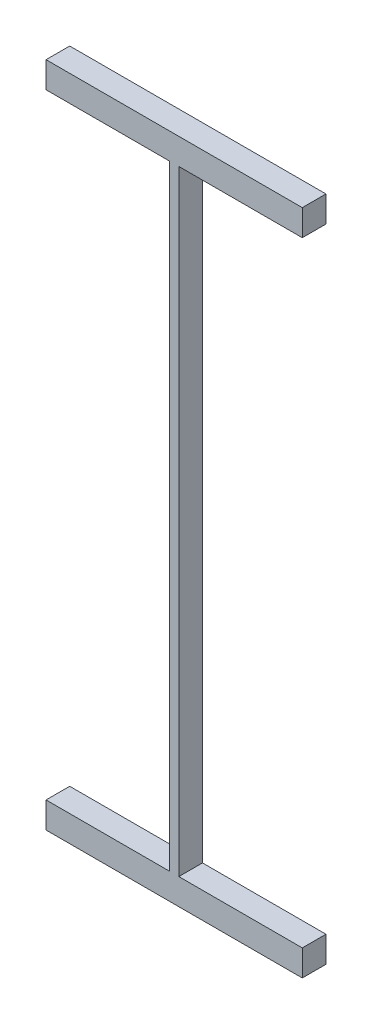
ISO-10303-21;
HEADER;
FILE_DESCRIPTION(('STEP AP214'),'2;1');
FILE_NAME('part.step','',(''),(''),'','','');
FILE_SCHEMA(('AUTOMOTIVE_DESIGN { 1 0 10303 214 1 1 1 1 }'));
ENDSEC;
DATA;
#1=APPLICATION_CONTEXT('core data for automotive mechanical design processes');
#2=APPLICATION_PROTOCOL_DEFINITION('international standard','automotive_design',2000,#1);
#3=PRODUCT_CONTEXT('',#1,'mechanical');
#4=PRODUCT('Part','Part','',(#3));
#5=PRODUCT_RELATED_PRODUCT_CATEGORY('part','',(#4));
#6=PRODUCT_DEFINITION_FORMATION('','',#4);
#7=PRODUCT_DEFINITION_CONTEXT('part definition',#1,'design');
#8=PRODUCT_DEFINITION('design','',#6,#7);
#9=PRODUCT_DEFINITION_SHAPE('','',#8);
#10=(LENGTH_UNIT() NAMED_UNIT(*) SI_UNIT(.MILLI.,.METRE.));
#11=(NAMED_UNIT(*) PLANE_ANGLE_UNIT() SI_UNIT($,.RADIAN.));
#12=(NAMED_UNIT(*) SI_UNIT($,.STERADIAN.) SOLID_ANGLE_UNIT());
#13=UNCERTAINTY_MEASURE_WITH_UNIT(LENGTH_MEASURE(1.E-05),#10,'distance_accuracy_value','');
#14=(GEOMETRIC_REPRESENTATION_CONTEXT(3) GLOBAL_UNCERTAINTY_ASSIGNED_CONTEXT((#13)) GLOBAL_UNIT_ASSIGNED_CONTEXT((#10,
#11,#12)) REPRESENTATION_CONTEXT('',''));
#15=CARTESIAN_POINT('',(0.,0.,0.));
#16=DIRECTION('',(0.,0.,1.));
#17=DIRECTION('',(1.,0.,0.));
#18=AXIS2_PLACEMENT_3D('',#15,#16,#17);
#19=CARTESIAN_POINT('',(-137.5,358.,12.7));
#20=DIRECTION('',(1.,0.,0.));
#21=DIRECTION('',(0.,1.,0.));
#22=AXIS2_PLACEMENT_3D('',#19,#20,#21);
#23=PLANE('',#22);
#24=DIRECTION('',(0.,-1.,0.));
#25=VECTOR('',#24,1.);
#26=CARTESIAN_POINT('',(-137.5,358.,-12.7));
#27=LINE('',#26,#25);
#28=CARTESIAN_POINT('',(-137.5,358.,-12.7));
#29=VERTEX_POINT('',#28);
#30=CARTESIAN_POINT('',(-137.5,330.,-12.7));
#31=VERTEX_POINT('',#30);
#32=EDGE_CURVE('E159',#29,#31,#27,.T.);
#33=ORIENTED_EDGE('',*,*,#32,.T.);
#34=DIRECTION('',(0.,0.,-1.));
#35=VECTOR('',#34,1.);
#36=CARTESIAN_POINT('',(-137.5,330.,12.7));
#37=LINE('',#36,#35);
#38=CARTESIAN_POINT('',(-137.5,330.,12.7));
#39=VERTEX_POINT('',#38);
#40=EDGE_CURVE('E11',#39,#31,#37,.T.);
#41=ORIENTED_EDGE('',*,*,#40,.F.);
#42=DIRECTION('',(0.,-1.,0.));
#43=VECTOR('',#42,1.);
#44=CARTESIAN_POINT('',(-137.5,358.,12.7));
#45=LINE('',#44,#43);
#46=CARTESIAN_POINT('',(-137.5,358.,12.7));
#47=VERTEX_POINT('',#46);
#48=EDGE_CURVE('E181',#47,#39,#45,.T.);
#49=ORIENTED_EDGE('',*,*,#48,.F.);
#50=DIRECTION('',(0.,0.,-1.));
#51=VECTOR('',#50,1.);
#52=CARTESIAN_POINT('',(-137.5,358.,12.7));
#53=LINE('',#52,#51);
#54=EDGE_CURVE('E155',#47,#29,#53,.T.);
#55=ORIENTED_EDGE('',*,*,#54,.T.);
#56=EDGE_LOOP('',(#33,#41,#49,#55));
#57=FACE_BOUND('',#56,.T.);
#58=ADVANCED_FACE('F39',(#57),#23,.F.);
#59=CARTESIAN_POINT('',(-137.5,330.,12.7));
#60=DIRECTION('',(0.,1.,0.));
#61=DIRECTION('',(0.,0.,1.));
#62=AXIS2_PLACEMENT_3D('',#59,#60,#61);
#63=PLANE('',#62);
#64=DIRECTION('',(1.,0.,0.));
#65=VECTOR('',#64,1.);
#66=CARTESIAN_POINT('',(-137.5,330.,-12.7));
#67=LINE('',#66,#65);
#68=CARTESIAN_POINT('',(-4.99999999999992,330.,-12.7));
#69=VERTEX_POINT('',#68);
#70=EDGE_CURVE('E162',#31,#69,#67,.T.);
#71=ORIENTED_EDGE('',*,*,#70,.T.);
#72=DIRECTION('',(0.,0.,-1.));
#73=VECTOR('',#72,1.);
#74=CARTESIAN_POINT('',(-4.99999999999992,330.,12.7));
#75=LINE('',#74,#73);
#76=CARTESIAN_POINT('',(-4.99999999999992,330.,12.7));
#77=VERTEX_POINT('',#76);
#78=EDGE_CURVE('E50',#77,#69,#75,.T.);
#79=ORIENTED_EDGE('',*,*,#78,.F.);
#80=DIRECTION('',(1.,0.,0.));
#81=VECTOR('',#80,1.);
#82=CARTESIAN_POINT('',(-137.5,330.,12.7));
#83=LINE('',#82,#81);
#84=EDGE_CURVE('E109',#39,#77,#83,.T.);
#85=ORIENTED_EDGE('',*,*,#84,.F.);
#86=ORIENTED_EDGE('',*,*,#40,.T.);
#87=EDGE_LOOP('',(#71,#79,#85,#86));
#88=FACE_BOUND('',#87,.T.);
#89=ADVANCED_FACE('F256',(#88),#63,.F.);
#90=CARTESIAN_POINT('',(-4.99999999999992,330.,12.7));
#91=DIRECTION('',(1.,0.,0.));
#92=DIRECTION('',(0.,0.,-1.));
#93=AXIS2_PLACEMENT_3D('',#90,#91,#92);
#94=PLANE('',#93);
#95=DIRECTION('',(0.,-1.,0.));
#96=VECTOR('',#95,1.);
#97=CARTESIAN_POINT('',(-4.99999999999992,330.,-12.7));
#98=LINE('',#97,#96);
#99=CARTESIAN_POINT('',(-4.99999999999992,-330.,-12.7));
#100=VERTEX_POINT('',#99);
#101=EDGE_CURVE('E165',#69,#100,#98,.T.);
#102=ORIENTED_EDGE('',*,*,#101,.T.);
#103=DIRECTION('',(0.,0.,-1.));
#104=VECTOR('',#103,1.);
#105=CARTESIAN_POINT('',(-4.99999999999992,-330.,12.7));
#106=LINE('',#105,#104);
#107=CARTESIAN_POINT('',(-4.99999999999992,-330.,12.7));
#108=VERTEX_POINT('',#107);
#109=EDGE_CURVE('E200',#108,#100,#106,.T.);
#110=ORIENTED_EDGE('',*,*,#109,.F.);
#111=DIRECTION('',(0.,-1.,0.));
#112=VECTOR('',#111,1.);
#113=CARTESIAN_POINT('',(-4.99999999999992,330.,12.7));
#114=LINE('',#113,#112);
#115=EDGE_CURVE('E206',#77,#108,#114,.T.);
#116=ORIENTED_EDGE('',*,*,#115,.F.);
#117=ORIENTED_EDGE('',*,*,#78,.T.);
#118=EDGE_LOOP('',(#102,#110,#116,#117));
#119=FACE_BOUND('',#118,.T.);
#120=ADVANCED_FACE('F207',(#119),#94,.F.);
#121=CARTESIAN_POINT('',(-137.5,-330.,12.7));
#122=DIRECTION('',(0.,-1.,0.));
#123=DIRECTION('',(0.,0.,-1.));
#124=AXIS2_PLACEMENT_3D('',#121,#122,#123);
#125=PLANE('',#124);
#126=DIRECTION('',(-1.,0.,0.));
#127=VECTOR('',#126,1.);
#128=CARTESIAN_POINT('',(-137.5,-330.,-12.7));
#129=LINE('',#128,#127);
#130=CARTESIAN_POINT('',(-137.5,-330.,-12.7));
#131=VERTEX_POINT('',#130);
#132=EDGE_CURVE('E168',#100,#131,#129,.T.);
#133=ORIENTED_EDGE('',*,*,#132,.T.);
#134=DIRECTION('',(0.,0.,-1.));
#135=VECTOR('',#134,1.);
#136=CARTESIAN_POINT('',(-137.5,-330.,12.7));
#137=LINE('',#136,#135);
#138=CARTESIAN_POINT('',(-137.5,-330.,12.7));
#139=VERTEX_POINT('',#138);
#140=EDGE_CURVE('E197',#139,#131,#137,.T.);
#141=ORIENTED_EDGE('',*,*,#140,.F.);
#142=DIRECTION('',(-1.,0.,0.));
#143=VECTOR('',#142,1.);
#144=CARTESIAN_POINT('',(-137.5,-330.,12.7));
#145=LINE('',#144,#143);
#146=EDGE_CURVE('E228',#108,#139,#145,.T.);
#147=ORIENTED_EDGE('',*,*,#146,.F.);
#148=ORIENTED_EDGE('',*,*,#109,.T.);
#149=EDGE_LOOP('',(#133,#141,#147,#148));
#150=FACE_BOUND('',#149,.T.);
#151=ADVANCED_FACE('F217',(#150),#125,.F.);
#152=CARTESIAN_POINT('',(-137.5,-330.,12.7));
#153=DIRECTION('',(1.,0.,0.));
#154=DIRECTION('',(0.,1.,0.));
#155=AXIS2_PLACEMENT_3D('',#152,#153,#154);
#156=PLANE('',#155);
#157=DIRECTION('',(0.,-1.,0.));
#158=VECTOR('',#157,1.);
#159=CARTESIAN_POINT('',(-137.5,-330.,-12.7));
#160=LINE('',#159,#158);
#161=CARTESIAN_POINT('',(-137.5,-358.,-12.7));
#162=VERTEX_POINT('',#161);
#163=EDGE_CURVE('E166',#131,#162,#160,.T.);
#164=ORIENTED_EDGE('',*,*,#163,.T.);
#165=DIRECTION('',(0.,0.,-1.));
#166=VECTOR('',#165,1.);
#167=CARTESIAN_POINT('',(-137.5,-358.,12.7));
#168=LINE('',#167,#166);
#169=CARTESIAN_POINT('',(-137.5,-358.,12.7));
#170=VERTEX_POINT('',#169);
#171=EDGE_CURVE('E191',#170,#162,#168,.T.);
#172=ORIENTED_EDGE('',*,*,#171,.F.);
#173=DIRECTION('',(0.,-1.,0.));
#174=VECTOR('',#173,1.);
#175=CARTESIAN_POINT('',(-137.5,-330.,12.7));
#176=LINE('',#175,#174);
#177=EDGE_CURVE('E223',#139,#170,#176,.T.);
#178=ORIENTED_EDGE('',*,*,#177,.F.);
#179=ORIENTED_EDGE('',*,*,#140,.T.);
#180=EDGE_LOOP('',(#164,#172,#178,#179));
#181=FACE_BOUND('',#180,.T.);
#182=ADVANCED_FACE('F222',(#181),#156,.F.);
#183=CARTESIAN_POINT('',(-137.5,-358.,12.7));
#184=DIRECTION('',(0.,1.,0.));
#185=DIRECTION('',(-1.,0.,0.));
#186=AXIS2_PLACEMENT_3D('',#183,#184,#185);
#187=PLANE('',#186);
#188=DIRECTION('',(1.,0.,0.));
#189=VECTOR('',#188,1.);
#190=CARTESIAN_POINT('',(-137.5,-358.,-12.7));
#191=LINE('',#190,#189);
#192=CARTESIAN_POINT('',(137.5,-358.,-12.7));
#193=VERTEX_POINT('',#192);
#194=EDGE_CURVE('E167',#162,#193,#191,.T.);
#195=ORIENTED_EDGE('',*,*,#194,.T.);
#196=DIRECTION('',(0.,0.,-1.));
#197=VECTOR('',#196,1.);
#198=CARTESIAN_POINT('',(137.5,-358.,12.7));
#199=LINE('',#198,#197);
#200=CARTESIAN_POINT('',(137.5,-358.,12.7));
#201=VERTEX_POINT('',#200);
#202=EDGE_CURVE('E192',#201,#193,#199,.T.);
#203=ORIENTED_EDGE('',*,*,#202,.F.);
#204=DIRECTION('',(1.,0.,0.));
#205=VECTOR('',#204,1.);
#206=CARTESIAN_POINT('',(-137.5,-358.,12.7));
#207=LINE('',#206,#205);
#208=EDGE_CURVE('E221',#170,#201,#207,.T.);
#209=ORIENTED_EDGE('',*,*,#208,.F.);
#210=ORIENTED_EDGE('',*,*,#171,.T.);
#211=EDGE_LOOP('',(#195,#203,#209,#210));
#212=FACE_BOUND('',#211,.T.);
#213=ADVANCED_FACE('F275',(#212),#187,.F.);
#214=CARTESIAN_POINT('',(137.5,-329.999999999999,12.7));
#215=DIRECTION('',(-1.,0.,0.));
#216=DIRECTION('',(0.,-1.,0.));
#217=AXIS2_PLACEMENT_3D('',#214,#215,#216);
#218=PLANE('',#217);
#219=DIRECTION('',(0.,1.,0.));
#220=VECTOR('',#219,1.);
#221=CARTESIAN_POINT('',(137.5,-329.999999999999,-12.7));
#222=LINE('',#221,#220);
#223=CARTESIAN_POINT('',(137.5,-329.999999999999,-12.7));
#224=VERTEX_POINT('',#223);
#225=EDGE_CURVE('E175',#193,#224,#222,.T.);
#226=ORIENTED_EDGE('',*,*,#225,.T.);
#227=DIRECTION('',(0.,0.,-1.));
#228=VECTOR('',#227,1.);
#229=CARTESIAN_POINT('',(137.5,-329.999999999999,12.7));
#230=LINE('',#229,#228);
#231=CARTESIAN_POINT('',(137.5,-329.999999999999,12.7));
#232=VERTEX_POINT('',#231);
#233=EDGE_CURVE('E189',#232,#224,#230,.T.);
#234=ORIENTED_EDGE('',*,*,#233,.F.);
#235=DIRECTION('',(0.,1.,0.));
#236=VECTOR('',#235,1.);
#237=CARTESIAN_POINT('',(137.5,-329.999999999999,12.7));
#238=LINE('',#237,#236);
#239=EDGE_CURVE('E226',#201,#232,#238,.T.);
#240=ORIENTED_EDGE('',*,*,#239,.F.);
#241=ORIENTED_EDGE('',*,*,#202,.T.);
#242=EDGE_LOOP('',(#226,#234,#240,#241));
#243=FACE_BOUND('',#242,.T.);
#244=ADVANCED_FACE('F273',(#243),#218,.F.);
#245=CARTESIAN_POINT('',(137.5,-329.999999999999,12.7));
#246=DIRECTION('',(0.,-1.,0.));
#247=DIRECTION('',(0.,0.,-1.));
#248=AXIS2_PLACEMENT_3D('',#245,#246,#247);
#249=PLANE('',#248);
#250=DIRECTION('',(-1.,0.,0.));
#251=VECTOR('',#250,1.);
#252=CARTESIAN_POINT('',(137.5,-329.999999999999,-12.7));
#253=LINE('',#252,#251);
#254=CARTESIAN_POINT('',(5.00000000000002,-329.999999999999,-12.7));
#255=VERTEX_POINT('',#254);
#256=EDGE_CURVE('E172',#224,#255,#253,.T.);
#257=ORIENTED_EDGE('',*,*,#256,.T.);
#258=DIRECTION('',(0.,0.,-1.));
#259=VECTOR('',#258,1.);
#260=CARTESIAN_POINT('',(5.00000000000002,-329.999999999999,12.7));
#261=LINE('',#260,#259);
#262=CARTESIAN_POINT('',(5.00000000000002,-329.999999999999,12.7));
#263=VERTEX_POINT('',#262);
#264=EDGE_CURVE('E184',#263,#255,#261,.T.);
#265=ORIENTED_EDGE('',*,*,#264,.F.);
#266=DIRECTION('',(-1.,0.,0.));
#267=VECTOR('',#266,1.);
#268=CARTESIAN_POINT('',(137.5,-329.999999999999,12.7));
#269=LINE('',#268,#267);
#270=EDGE_CURVE('E234',#232,#263,#269,.T.);
#271=ORIENTED_EDGE('',*,*,#270,.F.);
#272=ORIENTED_EDGE('',*,*,#233,.T.);
#273=EDGE_LOOP('',(#257,#265,#271,#272));
#274=FACE_BOUND('',#273,.T.);
#275=ADVANCED_FACE('F239',(#274),#249,.F.);
#276=CARTESIAN_POINT('',(5.00000000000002,330.,12.7));
#277=DIRECTION('',(-1.,0.,0.));
#278=DIRECTION('',(0.,0.,1.));
#279=AXIS2_PLACEMENT_3D('',#276,#277,#278);
#280=PLANE('',#279);
#281=DIRECTION('',(0.,1.,0.));
#282=VECTOR('',#281,1.);
#283=CARTESIAN_POINT('',(5.00000000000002,330.,-12.7));
#284=LINE('',#283,#282);
#285=CARTESIAN_POINT('',(5.00000000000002,330.,-12.7));
#286=VERTEX_POINT('',#285);
#287=EDGE_CURVE('E176',#255,#286,#284,.T.);
#288=ORIENTED_EDGE('',*,*,#287,.T.);
#289=DIRECTION('',(0.,0.,-1.));
#290=VECTOR('',#289,1.);
#291=CARTESIAN_POINT('',(5.00000000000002,330.,12.7));
#292=LINE('',#291,#290);
#293=CARTESIAN_POINT('',(5.00000000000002,330.,12.7));
#294=VERTEX_POINT('',#293);
#295=EDGE_CURVE('E148',#294,#286,#292,.T.);
#296=ORIENTED_EDGE('',*,*,#295,.F.);
#297=DIRECTION('',(0.,1.,0.));
#298=VECTOR('',#297,1.);
#299=CARTESIAN_POINT('',(5.00000000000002,330.,12.7));
#300=LINE('',#299,#298);
#301=EDGE_CURVE('E142',#263,#294,#300,.T.);
#302=ORIENTED_EDGE('',*,*,#301,.F.);
#303=ORIENTED_EDGE('',*,*,#264,.T.);
#304=EDGE_LOOP('',(#288,#296,#302,#303));
#305=FACE_BOUND('',#304,.T.);
#306=ADVANCED_FACE('F242',(#305),#280,.F.);
#307=CARTESIAN_POINT('',(137.5,330.,12.7));
#308=DIRECTION('',(0.,1.,0.));
#309=DIRECTION('',(0.,0.,1.));
#310=AXIS2_PLACEMENT_3D('',#307,#308,#309);
#311=PLANE('',#310);
#312=DIRECTION('',(1.,0.,0.));
#313=VECTOR('',#312,1.);
#314=CARTESIAN_POINT('',(137.5,330.,-12.7));
#315=LINE('',#314,#313);
#316=CARTESIAN_POINT('',(137.5,330.,-12.7));
#317=VERTEX_POINT('',#316);
#318=EDGE_CURVE('E146',#286,#317,#315,.T.);
#319=ORIENTED_EDGE('',*,*,#318,.T.);
#320=DIRECTION('',(0.,0.,-1.));
#321=VECTOR('',#320,1.);
#322=CARTESIAN_POINT('',(137.5,330.,12.7));
#323=LINE('',#322,#321);
#324=CARTESIAN_POINT('',(137.5,330.,12.7));
#325=VERTEX_POINT('',#324);
#326=EDGE_CURVE('E147',#325,#317,#323,.T.);
#327=ORIENTED_EDGE('',*,*,#326,.F.);
#328=DIRECTION('',(1.,0.,0.));
#329=VECTOR('',#328,1.);
#330=CARTESIAN_POINT('',(137.5,330.,12.7));
#331=LINE('',#330,#329);
#332=EDGE_CURVE('E135',#294,#325,#331,.T.);
#333=ORIENTED_EDGE('',*,*,#332,.F.);
#334=ORIENTED_EDGE('',*,*,#295,.T.);
#335=EDGE_LOOP('',(#319,#327,#333,#334));
#336=FACE_BOUND('',#335,.T.);
#337=ADVANCED_FACE('F150',(#336),#311,.F.);
#338=CARTESIAN_POINT('',(137.5,358.,12.7));
#339=DIRECTION('',(-1.,0.,0.));
#340=DIRECTION('',(0.,-1.,0.));
#341=AXIS2_PLACEMENT_3D('',#338,#339,#340);
#342=PLANE('',#341);
#343=DIRECTION('',(0.,1.,0.));
#344=VECTOR('',#343,1.);
#345=CARTESIAN_POINT('',(137.5,358.,-12.7));
#346=LINE('',#345,#344);
#347=CARTESIAN_POINT('',(137.5,358.,-12.7));
#348=VERTEX_POINT('',#347);
#349=EDGE_CURVE('E98',#317,#348,#346,.T.);
#350=ORIENTED_EDGE('',*,*,#349,.T.);
#351=DIRECTION('',(0.,0.,-1.));
#352=VECTOR('',#351,1.);
#353=CARTESIAN_POINT('',(137.5,358.,12.7));
#354=LINE('',#353,#352);
#355=CARTESIAN_POINT('',(137.5,358.,12.7));
#356=VERTEX_POINT('',#355);
#357=EDGE_CURVE('E151',#356,#348,#354,.T.);
#358=ORIENTED_EDGE('',*,*,#357,.F.);
#359=DIRECTION('',(0.,1.,0.));
#360=VECTOR('',#359,1.);
#361=CARTESIAN_POINT('',(137.5,358.,12.7));
#362=LINE('',#361,#360);
#363=EDGE_CURVE('E139',#325,#356,#362,.T.);
#364=ORIENTED_EDGE('',*,*,#363,.F.);
#365=ORIENTED_EDGE('',*,*,#326,.T.);
#366=EDGE_LOOP('',(#350,#358,#364,#365));
#367=FACE_BOUND('',#366,.T.);
#368=ADVANCED_FACE('F154',(#367),#342,.F.);
#369=CARTESIAN_POINT('',(-137.5,358.,12.7));
#370=DIRECTION('',(0.,-1.,0.));
#371=DIRECTION('',(0.,0.,-1.));
#372=AXIS2_PLACEMENT_3D('',#369,#370,#371);
#373=PLANE('',#372);
#374=DIRECTION('',(-1.,0.,0.));
#375=VECTOR('',#374,1.);
#376=CARTESIAN_POINT('',(-137.5,358.,-12.7));
#377=LINE('',#376,#375);
#378=EDGE_CURVE('E105',#348,#29,#377,.T.);
#379=ORIENTED_EDGE('',*,*,#378,.T.);
#380=ORIENTED_EDGE('',*,*,#54,.F.);
#381=DIRECTION('',(-1.,0.,0.));
#382=VECTOR('',#381,1.);
#383=CARTESIAN_POINT('',(-137.5,358.,12.7));
#384=LINE('',#383,#382);
#385=EDGE_CURVE('E54',#356,#47,#384,.T.);
#386=ORIENTED_EDGE('',*,*,#385,.F.);
#387=ORIENTED_EDGE('',*,*,#357,.T.);
#388=EDGE_LOOP('',(#379,#380,#386,#387));
#389=FACE_BOUND('',#388,.T.);
#390=ADVANCED_FACE('F247',(#389),#373,.F.);
#391=CARTESIAN_POINT('',(-137.5,330.,12.7));
#392=DIRECTION('',(0.,0.,1.));
#393=DIRECTION('',(1.,0.,0.));
#394=AXIS2_PLACEMENT_3D('',#391,#392,#393);
#395=PLANE('',#394);
#396=ORIENTED_EDGE('',*,*,#48,.T.);
#397=ORIENTED_EDGE('',*,*,#84,.T.);
#398=ORIENTED_EDGE('',*,*,#115,.T.);
#399=ORIENTED_EDGE('',*,*,#146,.T.);
#400=ORIENTED_EDGE('',*,*,#177,.T.);
#401=ORIENTED_EDGE('',*,*,#208,.T.);
#402=ORIENTED_EDGE('',*,*,#239,.T.);
#403=ORIENTED_EDGE('',*,*,#270,.T.);
#404=ORIENTED_EDGE('',*,*,#301,.T.);
#405=ORIENTED_EDGE('',*,*,#332,.T.);
#406=ORIENTED_EDGE('',*,*,#363,.T.);
#407=ORIENTED_EDGE('',*,*,#385,.T.);
#408=EDGE_LOOP('',(#396,#397,#398,#399,#400,#401,#402,#403,#404,#405,#406,#407));
#409=FACE_BOUND('',#408,.T.);
#410=ADVANCED_FACE('F140',(#409),#395,.T.);
#411=CARTESIAN_POINT('',(-137.5,330.,-12.7));
#412=DIRECTION('',(0.,0.,1.));
#413=DIRECTION('',(1.,0.,0.));
#414=AXIS2_PLACEMENT_3D('',#411,#412,#413);
#415=PLANE('',#414);
#416=ORIENTED_EDGE('',*,*,#32,.F.);
#417=ORIENTED_EDGE('',*,*,#378,.F.);
#418=ORIENTED_EDGE('',*,*,#349,.F.);
#419=ORIENTED_EDGE('',*,*,#318,.F.);
#420=ORIENTED_EDGE('',*,*,#287,.F.);
#421=ORIENTED_EDGE('',*,*,#256,.F.);
#422=ORIENTED_EDGE('',*,*,#225,.F.);
#423=ORIENTED_EDGE('',*,*,#194,.F.);
#424=ORIENTED_EDGE('',*,*,#163,.F.);
#425=ORIENTED_EDGE('',*,*,#132,.F.);
#426=ORIENTED_EDGE('',*,*,#101,.F.);
#427=ORIENTED_EDGE('',*,*,#70,.F.);
#428=EDGE_LOOP('',(#416,#417,#418,#419,#420,#421,#422,#423,#424,#425,#426,#427));
#429=FACE_BOUND('',#428,.T.);
#430=ADVANCED_FACE('F215',(#429),#415,.F.);
#431=CLOSED_SHELL('',(#58,#89,#120,#151,#182,#213,#244,#275,#306,#337,#368,#390,#410,#430));
#432=MANIFOLD_SOLID_BREP('B2',#431);
#433=ADVANCED_BREP_SHAPE_REPRESENTATION('',(#18,#432),#14);
#434=SHAPE_DEFINITION_REPRESENTATION(#9,#433);
ENDSEC;
END-ISO-10303-21;
